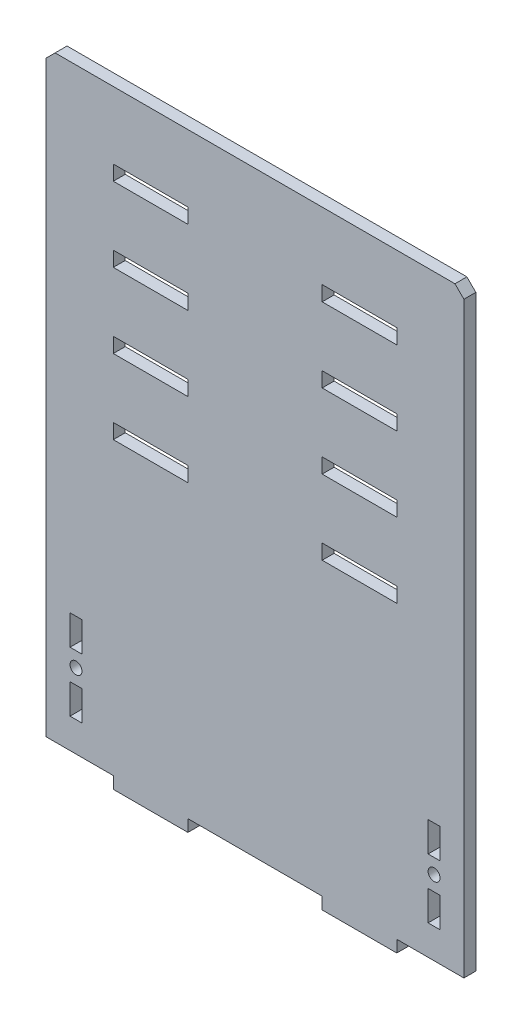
from build123d import *

# Parameters (mm, degrees)
BOSS_EXTRUDE1_DEPTH     = 4
SKETCH2_W               = 25
SKETCH2_H               = 4
BOSS_EXTRUDE2_DEPTH     = 4
CUT_EXTRUDE1_DEPTH      = 126.427269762
CUT_EXTRUDE1_DEPTH_BACK = 126.427269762
SKETCH3_W               = 25
SKETCH3_H               = 5
CUT_EXTRUDE2_DEPTH      = 126.427269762
CUT_EXTRUDE2_DEPTH_BACK = 126.427269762
SKETCH4_R               = 2
SKETCH4_W               = 4
SKETCH4_H               = 10


with BuildPart() as part:
    # Sketch1 → Boss-Extrude1 (new body)
    with BuildSketch(Plane.XY):
        Polygon((-70, 97), (-67, 100), (67, 100), (70, 97), (70, -100), (-70, -100), align=None)
    extrude(amount=-BOSS_EXTRUDE1_DEPTH)

    # Sketch2 → Boss-Extrude2 (add)
    with BuildSketch(Plane.XY):
        with Locations((35, -102)):
            Rectangle(SKETCH2_W, SKETCH2_H)
        with Locations((-35, -102)):
            Rectangle(SKETCH2_W, SKETCH2_H)
    extrude(amount=-BOSS_EXTRUDE2_DEPTH)

    # Sketch3 → Cut-Extrude1 (cut, two sides: drawn at the far end of the back side and taken through both)
    with BuildSketch(Plane.XY.offset(-CUT_EXTRUDE1_DEPTH_BACK)):
        with Locations((35, 0)):
            Rectangle(SKETCH3_W, SKETCH3_H)
        with Locations((-35, 0)):
            Rectangle(SKETCH3_W, SKETCH3_H)
        with Locations((35, 25)):
            Rectangle(SKETCH3_W, SKETCH3_H)
        with Locations((35, 50)):
            Rectangle(SKETCH3_W, SKETCH3_H)
        with Locations((35, 75)):
            Rectangle(SKETCH3_W, SKETCH3_H)
        with Locations((-35, 25)):
            Rectangle(SKETCH3_W, SKETCH3_H)
        with Locations((-35, 50)):
            Rectangle(SKETCH3_W, SKETCH3_H)
        with Locations((-35, 75)):
            Rectangle(SKETCH3_W, SKETCH3_H)
    extrude(amount=CUT_EXTRUDE1_DEPTH + CUT_EXTRUDE1_DEPTH_BACK, mode=Mode.SUBTRACT)

    # Sketch4 → Cut-Extrude2 (cut, two sides: drawn at the far end of the back side and taken through both)
    with BuildSketch(Plane.XY.offset(-CUT_EXTRUDE2_DEPTH_BACK)):
        with Locations((-60, -75)):
            Circle(SKETCH4_R)
        with Locations((60, -75)):
            Circle(SKETCH4_R)
        with Locations((-60, -85)):
            Rectangle(SKETCH4_W, SKETCH4_H)
        with Locations((60, -85)):
            Rectangle(SKETCH4_W, SKETCH4_H)
        with Locations((60, -65)):
            Rectangle(SKETCH4_W, SKETCH4_H)
        with Locations((-60, -65)):
            Rectangle(SKETCH4_W, SKETCH4_H)
    extrude(amount=CUT_EXTRUDE2_DEPTH + CUT_EXTRUDE2_DEPTH_BACK, mode=Mode.SUBTRACT)


solid = part.part
